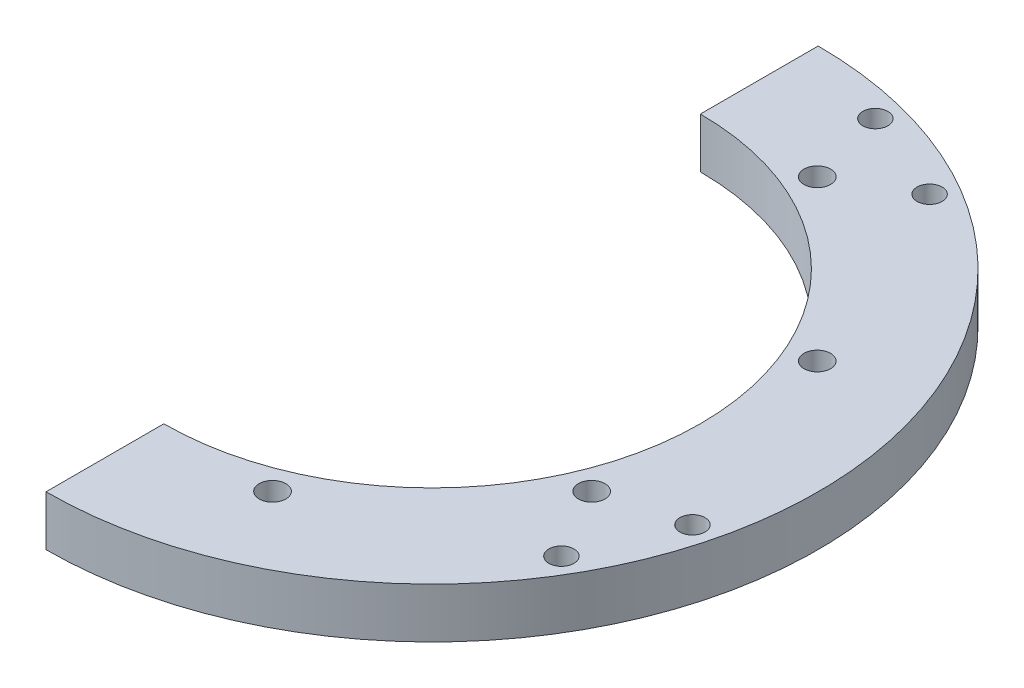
ISO-10303-21;
HEADER;
FILE_DESCRIPTION(('STEP AP214'),'2;1');
FILE_NAME('part.step','',(''),(''),'','','');
FILE_SCHEMA(('AUTOMOTIVE_DESIGN { 1 0 10303 214 1 1 1 1 }'));
ENDSEC;
DATA;
#1=APPLICATION_CONTEXT('core data for automotive mechanical design processes');
#2=APPLICATION_PROTOCOL_DEFINITION('international standard','automotive_design',2000,#1);
#3=PRODUCT_CONTEXT('',#1,'mechanical');
#4=PRODUCT('Part','Part','',(#3));
#5=PRODUCT_RELATED_PRODUCT_CATEGORY('part','',(#4));
#6=PRODUCT_DEFINITION_FORMATION('','',#4);
#7=PRODUCT_DEFINITION_CONTEXT('part definition',#1,'design');
#8=PRODUCT_DEFINITION('design','',#6,#7);
#9=PRODUCT_DEFINITION_SHAPE('','',#8);
#10=(LENGTH_UNIT() NAMED_UNIT(*) SI_UNIT(.MILLI.,.METRE.));
#11=(NAMED_UNIT(*) PLANE_ANGLE_UNIT() SI_UNIT($,.RADIAN.));
#12=(NAMED_UNIT(*) SI_UNIT($,.STERADIAN.) SOLID_ANGLE_UNIT());
#13=UNCERTAINTY_MEASURE_WITH_UNIT(LENGTH_MEASURE(1.E-05),#10,'distance_accuracy_value','');
#14=(GEOMETRIC_REPRESENTATION_CONTEXT(3) GLOBAL_UNCERTAINTY_ASSIGNED_CONTEXT((#13)) GLOBAL_UNIT_ASSIGNED_CONTEXT((#10,
#11,#12)) REPRESENTATION_CONTEXT('',''));
#15=CARTESIAN_POINT('',(0.,0.,0.));
#16=DIRECTION('',(0.,0.,1.));
#17=DIRECTION('',(1.,0.,0.));
#18=AXIS2_PLACEMENT_3D('',#15,#16,#17);
#19=CARTESIAN_POINT('',(0.,12.7,0.));
#20=DIRECTION('',(0.,-1.,0.));
#21=DIRECTION('',(0.,0.,-1.));
#22=AXIS2_PLACEMENT_3D('',#19,#20,#21);
#23=PLANE('',#22);
#24=CARTESIAN_POINT('',(28.577267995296,12.7,68.9916279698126));
#25=DIRECTION('',(0.,1.,0.));
#26=DIRECTION('',(0.,0.,1.));
#27=AXIS2_PLACEMENT_3D('',#24,#25,#26);
#28=CIRCLE('',#27,3.37819999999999);
#29=CARTESIAN_POINT('',(28.577267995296,12.7,72.3698279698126));
#30=VERTEX_POINT('',#29);
#31=EDGE_CURVE('E144',#30,#30,#28,.T.);
#32=ORIENTED_EDGE('',*,*,#31,.F.);
#33=EDGE_LOOP('',(#32));
#34=FACE_BOUND('',#33,.T.);
#35=CARTESIAN_POINT('',(0.,12.7,0.));
#36=DIRECTION('',(0.,-1.,0.));
#37=DIRECTION('',(0.,0.,-1.));
#38=AXIS2_PLACEMENT_3D('',#35,#36,#37);
#39=CIRCLE('',#38,67.945);
#40=CARTESIAN_POINT('',(0.,12.7,-67.945));
#41=VERTEX_POINT('',#40);
#42=CARTESIAN_POINT('',(0.,12.7,67.945));
#43=VERTEX_POINT('',#42);
#44=EDGE_CURVE('E85',#41,#43,#39,.T.);
#45=ORIENTED_EDGE('',*,*,#44,.T.);
#46=DIRECTION('',(0.,0.,1.));
#47=VECTOR('',#46,1.);
#48=CARTESIAN_POINT('',(0.,12.7,67.945));
#49=LINE('',#48,#47);
#50=CARTESIAN_POINT('',(0.,12.7,97.79));
#51=VERTEX_POINT('',#50);
#52=EDGE_CURVE('E80',#43,#51,#49,.T.);
#53=ORIENTED_EDGE('',*,*,#52,.T.);
#54=CARTESIAN_POINT('',(0.,12.7,0.));
#55=DIRECTION('',(0.,1.,0.));
#56=DIRECTION('',(0.,0.,-1.));
#57=AXIS2_PLACEMENT_3D('',#54,#55,#56);
#58=CIRCLE('',#57,97.79);
#59=CARTESIAN_POINT('',(0.,12.7,-97.79));
#60=VERTEX_POINT('',#59);
#61=EDGE_CURVE('E83',#51,#60,#58,.T.);
#62=ORIENTED_EDGE('',*,*,#61,.T.);
#63=DIRECTION('',(0.,0.,1.));
#64=VECTOR('',#63,1.);
#65=CARTESIAN_POINT('',(0.,12.7,-97.79));
#66=LINE('',#65,#64);
#67=EDGE_CURVE('E50',#60,#41,#66,.T.);
#68=ORIENTED_EDGE('',*,*,#67,.T.);
#69=EDGE_LOOP('',(#45,#53,#62,#68));
#70=FACE_BOUND('',#69,.T.);
#71=CARTESIAN_POINT('',(28.5772679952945,12.7,-68.9916279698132));
#72=DIRECTION('',(0.,1.,0.));
#73=DIRECTION('',(0.,0.,1.));
#74=AXIS2_PLACEMENT_3D('',#71,#72,#73);
#75=CIRCLE('',#74,3.37819999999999);
#76=CARTESIAN_POINT('',(28.5772679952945,12.7,-65.6134279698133));
#77=VERTEX_POINT('',#76);
#78=EDGE_CURVE('E114',#77,#77,#75,.T.);
#79=ORIENTED_EDGE('',*,*,#78,.F.);
#80=EDGE_LOOP('',(#79));
#81=FACE_BOUND('',#80,.T.);
#82=CARTESIAN_POINT('',(46.6320596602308,12.7,-79.393051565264));
#83=DIRECTION('',(0.,1.,0.));
#84=DIRECTION('',(0.,0.,1.));
#85=AXIS2_PLACEMENT_3D('',#82,#83,#84);
#86=CIRCLE('',#85,3.17499999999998);
#87=CARTESIAN_POINT('',(46.6320596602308,12.7,-76.218051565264));
#88=VERTEX_POINT('',#87);
#89=EDGE_CURVE('E120',#88,#88,#86,.T.);
#90=ORIENTED_EDGE('',*,*,#89,.F.);
#91=EDGE_LOOP('',(#90));
#92=FACE_BOUND('',#91,.T.);
#93=CARTESIAN_POINT('',(23.165519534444,12.7,-89.113210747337));
#94=DIRECTION('',(0.,1.,0.));
#95=DIRECTION('',(0.,0.,1.));
#96=AXIS2_PLACEMENT_3D('',#93,#94,#95);
#97=CIRCLE('',#96,3.17499999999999);
#98=CARTESIAN_POINT('',(23.165519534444,12.7,-85.938210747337));
#99=VERTEX_POINT('',#98);
#100=EDGE_CURVE('E126',#99,#99,#97,.T.);
#101=ORIENTED_EDGE('',*,*,#100,.F.);
#102=EDGE_LOOP('',(#101));
#103=FACE_BOUND('',#102,.T.);
#104=CARTESIAN_POINT('',(68.9916279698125,12.7,-28.5772679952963));
#105=DIRECTION('',(0.,1.,0.));
#106=DIRECTION('',(0.,0.,1.));
#107=AXIS2_PLACEMENT_3D('',#104,#105,#106);
#108=CIRCLE('',#107,3.37819999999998);
#109=CARTESIAN_POINT('',(68.9916279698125,12.7,-25.1990679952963));
#110=VERTEX_POINT('',#109);
#111=EDGE_CURVE('E132',#110,#110,#108,.T.);
#112=ORIENTED_EDGE('',*,*,#111,.F.);
#113=EDGE_LOOP('',(#112));
#114=FACE_BOUND('',#113,.T.);
#115=CARTESIAN_POINT('',(68.9916279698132,12.7,28.5772679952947));
#116=DIRECTION('',(0.,1.,0.));
#117=DIRECTION('',(0.,0.,1.));
#118=AXIS2_PLACEMENT_3D('',#115,#116,#117);
#119=CIRCLE('',#118,3.37819999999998);
#120=CARTESIAN_POINT('',(68.9916279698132,12.7,31.9554679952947));
#121=VERTEX_POINT('',#120);
#122=EDGE_CURVE('E138',#121,#121,#119,.T.);
#123=ORIENTED_EDGE('',*,*,#122,.F.);
#124=EDGE_LOOP('',(#123));
#125=FACE_BOUND('',#124,.T.);
#126=CARTESIAN_POINT('',(79.3930515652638,12.7,46.6320596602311));
#127=DIRECTION('',(0.,1.,0.));
#128=DIRECTION('',(0.,0.,1.));
#129=AXIS2_PLACEMENT_3D('',#126,#127,#128);
#130=CIRCLE('',#129,3.17499999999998);
#131=CARTESIAN_POINT('',(79.3930515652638,12.7,49.8070596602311));
#132=VERTEX_POINT('',#131);
#133=EDGE_CURVE('E150',#132,#132,#130,.T.);
#134=ORIENTED_EDGE('',*,*,#133,.F.);
#135=EDGE_LOOP('',(#134));
#136=FACE_BOUND('',#135,.T.);
#137=CARTESIAN_POINT('',(89.1132107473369,12.7,23.1655195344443));
#138=DIRECTION('',(0.,1.,0.));
#139=DIRECTION('',(0.,0.,1.));
#140=AXIS2_PLACEMENT_3D('',#137,#138,#139);
#141=CIRCLE('',#140,3.17499999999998);
#142=CARTESIAN_POINT('',(89.1132107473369,12.7,26.3405195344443));
#143=VERTEX_POINT('',#142);
#144=EDGE_CURVE('E156',#143,#143,#141,.T.);
#145=ORIENTED_EDGE('',*,*,#144,.F.);
#146=EDGE_LOOP('',(#145));
#147=FACE_BOUND('',#146,.T.);
#148=ADVANCED_FACE('F33',(#34,#70,#81,#92,#103,#114,#125,#136,#147),#23,.F.);
#149=CARTESIAN_POINT('',(0.,0.,0.));
#150=DIRECTION('',(0.,-1.,0.));
#151=DIRECTION('',(0.,0.,-1.));
#152=AXIS2_PLACEMENT_3D('',#149,#150,#151);
#153=PLANE('',#152);
#154=CARTESIAN_POINT('',(89.1132107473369,0.,23.1655195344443));
#155=DIRECTION('',(0.,1.,0.));
#156=DIRECTION('',(0.,0.,1.));
#157=AXIS2_PLACEMENT_3D('',#154,#155,#156);
#158=CIRCLE('',#157,3.175);
#159=CARTESIAN_POINT('',(89.1132107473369,0.,26.3405195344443));
#160=VERTEX_POINT('',#159);
#161=EDGE_CURVE('E153',#160,#160,#158,.T.);
#162=ORIENTED_EDGE('',*,*,#161,.T.);
#163=EDGE_LOOP('',(#162));
#164=FACE_BOUND('',#163,.T.);
#165=CARTESIAN_POINT('',(28.577267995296,0.,68.9916279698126));
#166=DIRECTION('',(0.,1.,0.));
#167=DIRECTION('',(0.,0.,1.));
#168=AXIS2_PLACEMENT_3D('',#165,#166,#167);
#169=CIRCLE('',#168,3.3782);
#170=CARTESIAN_POINT('',(28.577267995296,0.,72.3698279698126));
#171=VERTEX_POINT('',#170);
#172=EDGE_CURVE('E141',#171,#171,#169,.T.);
#173=ORIENTED_EDGE('',*,*,#172,.T.);
#174=EDGE_LOOP('',(#173));
#175=FACE_BOUND('',#174,.T.);
#176=CARTESIAN_POINT('',(68.9916279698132,0.,28.5772679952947));
#177=DIRECTION('',(0.,1.,0.));
#178=DIRECTION('',(0.,0.,1.));
#179=AXIS2_PLACEMENT_3D('',#176,#177,#178);
#180=CIRCLE('',#179,3.3782);
#181=CARTESIAN_POINT('',(68.9916279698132,0.,31.9554679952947));
#182=VERTEX_POINT('',#181);
#183=EDGE_CURVE('E135',#182,#182,#180,.T.);
#184=ORIENTED_EDGE('',*,*,#183,.T.);
#185=EDGE_LOOP('',(#184));
#186=FACE_BOUND('',#185,.T.);
#187=CARTESIAN_POINT('',(0.,0.,0.));
#188=DIRECTION('',(0.,-1.,0.));
#189=DIRECTION('',(0.,0.,-1.));
#190=AXIS2_PLACEMENT_3D('',#187,#188,#189);
#191=CIRCLE('',#190,67.945);
#192=CARTESIAN_POINT('',(0.,0.,-67.945));
#193=VERTEX_POINT('',#192);
#194=CARTESIAN_POINT('',(0.,0.,67.945));
#195=VERTEX_POINT('',#194);
#196=EDGE_CURVE('E97',#193,#195,#191,.T.);
#197=ORIENTED_EDGE('',*,*,#196,.F.);
#198=DIRECTION('',(0.,0.,1.));
#199=VECTOR('',#198,1.);
#200=CARTESIAN_POINT('',(0.,0.,-97.79));
#201=LINE('',#200,#199);
#202=CARTESIAN_POINT('',(0.,0.,-97.79));
#203=VERTEX_POINT('',#202);
#204=EDGE_CURVE('E73',#203,#193,#201,.T.);
#205=ORIENTED_EDGE('',*,*,#204,.F.);
#206=CARTESIAN_POINT('',(0.,0.,0.));
#207=DIRECTION('',(0.,1.,0.));
#208=DIRECTION('',(0.,0.,-1.));
#209=AXIS2_PLACEMENT_3D('',#206,#207,#208);
#210=CIRCLE('',#209,97.79);
#211=CARTESIAN_POINT('',(0.,0.,97.79));
#212=VERTEX_POINT('',#211);
#213=EDGE_CURVE('E67',#212,#203,#210,.T.);
#214=ORIENTED_EDGE('',*,*,#213,.F.);
#215=DIRECTION('',(0.,0.,1.));
#216=VECTOR('',#215,1.);
#217=CARTESIAN_POINT('',(0.,0.,67.945));
#218=LINE('',#217,#216);
#219=EDGE_CURVE('E89',#195,#212,#218,.T.);
#220=ORIENTED_EDGE('',*,*,#219,.F.);
#221=EDGE_LOOP('',(#197,#205,#214,#220));
#222=FACE_BOUND('',#221,.T.);
#223=CARTESIAN_POINT('',(28.5772679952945,0.,-68.9916279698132));
#224=DIRECTION('',(0.,1.,0.));
#225=DIRECTION('',(0.,0.,1.));
#226=AXIS2_PLACEMENT_3D('',#223,#224,#225);
#227=CIRCLE('',#226,3.37819999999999);
#228=CARTESIAN_POINT('',(28.5772679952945,0.,-65.6134279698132));
#229=VERTEX_POINT('',#228);
#230=EDGE_CURVE('E100',#229,#229,#227,.T.);
#231=ORIENTED_EDGE('',*,*,#230,.T.);
#232=EDGE_LOOP('',(#231));
#233=FACE_BOUND('',#232,.T.);
#234=CARTESIAN_POINT('',(46.6320596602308,0.,-79.393051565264));
#235=DIRECTION('',(0.,1.,0.));
#236=DIRECTION('',(0.,0.,1.));
#237=AXIS2_PLACEMENT_3D('',#234,#235,#236);
#238=CIRCLE('',#237,3.175);
#239=CARTESIAN_POINT('',(46.6320596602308,0.,-76.218051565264));
#240=VERTEX_POINT('',#239);
#241=EDGE_CURVE('E117',#240,#240,#238,.T.);
#242=ORIENTED_EDGE('',*,*,#241,.T.);
#243=EDGE_LOOP('',(#242));
#244=FACE_BOUND('',#243,.T.);
#245=CARTESIAN_POINT('',(23.165519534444,0.,-89.113210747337));
#246=DIRECTION('',(0.,1.,0.));
#247=DIRECTION('',(0.,0.,1.));
#248=AXIS2_PLACEMENT_3D('',#245,#246,#247);
#249=CIRCLE('',#248,3.175);
#250=CARTESIAN_POINT('',(23.165519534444,0.,-85.938210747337));
#251=VERTEX_POINT('',#250);
#252=EDGE_CURVE('E123',#251,#251,#249,.T.);
#253=ORIENTED_EDGE('',*,*,#252,.T.);
#254=EDGE_LOOP('',(#253));
#255=FACE_BOUND('',#254,.T.);
#256=CARTESIAN_POINT('',(68.9916279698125,0.,-28.5772679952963));
#257=DIRECTION('',(0.,1.,0.));
#258=DIRECTION('',(0.,0.,1.));
#259=AXIS2_PLACEMENT_3D('',#256,#257,#258);
#260=CIRCLE('',#259,3.3782);
#261=CARTESIAN_POINT('',(68.9916279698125,0.,-25.1990679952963));
#262=VERTEX_POINT('',#261);
#263=EDGE_CURVE('E129',#262,#262,#260,.T.);
#264=ORIENTED_EDGE('',*,*,#263,.T.);
#265=EDGE_LOOP('',(#264));
#266=FACE_BOUND('',#265,.T.);
#267=CARTESIAN_POINT('',(79.3930515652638,0.,46.6320596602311));
#268=DIRECTION('',(0.,1.,0.));
#269=DIRECTION('',(0.,0.,1.));
#270=AXIS2_PLACEMENT_3D('',#267,#268,#269);
#271=CIRCLE('',#270,3.175);
#272=CARTESIAN_POINT('',(79.3930515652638,0.,49.8070596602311));
#273=VERTEX_POINT('',#272);
#274=EDGE_CURVE('E147',#273,#273,#271,.T.);
#275=ORIENTED_EDGE('',*,*,#274,.T.);
#276=EDGE_LOOP('',(#275));
#277=FACE_BOUND('',#276,.T.);
#278=ADVANCED_FACE('F108',(#164,#175,#186,#222,#233,#244,#255,#266,#277),#153,.T.);
#279=CARTESIAN_POINT('',(0.,12.7,0.));
#280=DIRECTION('',(0.,-1.,0.));
#281=DIRECTION('',(0.,0.,-1.));
#282=AXIS2_PLACEMENT_3D('',#279,#280,#281);
#283=CYLINDRICAL_SURFACE('',#282,67.945);
#284=ORIENTED_EDGE('',*,*,#196,.T.);
#285=DIRECTION('',(0.,-1.,0.));
#286=VECTOR('',#285,1.);
#287=CARTESIAN_POINT('',(0.,12.7,67.945));
#288=LINE('',#287,#286);
#289=EDGE_CURVE('E11',#43,#195,#288,.T.);
#290=ORIENTED_EDGE('',*,*,#289,.F.);
#291=ORIENTED_EDGE('',*,*,#44,.F.);
#292=DIRECTION('',(0.,-1.,0.));
#293=VECTOR('',#292,1.);
#294=CARTESIAN_POINT('',(0.,12.7,-67.945));
#295=LINE('',#294,#293);
#296=EDGE_CURVE('E93',#41,#193,#295,.T.);
#297=ORIENTED_EDGE('',*,*,#296,.T.);
#298=EDGE_LOOP('',(#284,#290,#291,#297));
#299=FACE_BOUND('',#298,.T.);
#300=ADVANCED_FACE('F35',(#299),#283,.F.);
#301=CARTESIAN_POINT('',(0.,12.7,67.945));
#302=DIRECTION('',(1.,0.,0.));
#303=DIRECTION('',(0.,0.,-1.));
#304=AXIS2_PLACEMENT_3D('',#301,#302,#303);
#305=PLANE('',#304);
#306=ORIENTED_EDGE('',*,*,#219,.T.);
#307=DIRECTION('',(0.,-1.,0.));
#308=VECTOR('',#307,1.);
#309=CARTESIAN_POINT('',(0.,12.7,97.79));
#310=LINE('',#309,#308);
#311=EDGE_CURVE('E42',#51,#212,#310,.T.);
#312=ORIENTED_EDGE('',*,*,#311,.F.);
#313=ORIENTED_EDGE('',*,*,#52,.F.);
#314=ORIENTED_EDGE('',*,*,#289,.T.);
#315=EDGE_LOOP('',(#306,#312,#313,#314));
#316=FACE_BOUND('',#315,.T.);
#317=ADVANCED_FACE('F88',(#316),#305,.F.);
#318=CARTESIAN_POINT('',(0.,12.7,0.));
#319=DIRECTION('',(0.,-1.,0.));
#320=DIRECTION('',(0.,0.,-1.));
#321=AXIS2_PLACEMENT_3D('',#318,#319,#320);
#322=CYLINDRICAL_SURFACE('',#321,97.79);
#323=ORIENTED_EDGE('',*,*,#213,.T.);
#324=DIRECTION('',(0.,-1.,0.));
#325=VECTOR('',#324,1.);
#326=CARTESIAN_POINT('',(0.,12.7,-97.79));
#327=LINE('',#326,#325);
#328=EDGE_CURVE('E90',#60,#203,#327,.T.);
#329=ORIENTED_EDGE('',*,*,#328,.F.);
#330=ORIENTED_EDGE('',*,*,#61,.F.);
#331=ORIENTED_EDGE('',*,*,#311,.T.);
#332=EDGE_LOOP('',(#323,#329,#330,#331));
#333=FACE_BOUND('',#332,.T.);
#334=ADVANCED_FACE('F91',(#333),#322,.T.);
#335=CARTESIAN_POINT('',(0.,12.7,-97.79));
#336=DIRECTION('',(1.,0.,0.));
#337=DIRECTION('',(0.,0.,-1.));
#338=AXIS2_PLACEMENT_3D('',#335,#336,#337);
#339=PLANE('',#338);
#340=ORIENTED_EDGE('',*,*,#204,.T.);
#341=ORIENTED_EDGE('',*,*,#296,.F.);
#342=ORIENTED_EDGE('',*,*,#67,.F.);
#343=ORIENTED_EDGE('',*,*,#328,.T.);
#344=EDGE_LOOP('',(#340,#341,#342,#343));
#345=FACE_BOUND('',#344,.T.);
#346=ADVANCED_FACE('F105',(#345),#339,.F.);
#347=CARTESIAN_POINT('',(28.5772679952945,12.7,-68.9916279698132));
#348=DIRECTION('',(0.,1.,0.));
#349=DIRECTION('',(0.,0.,1.));
#350=AXIS2_PLACEMENT_3D('',#347,#348,#349);
#351=CYLINDRICAL_SURFACE('',#350,3.37819999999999);
#352=ORIENTED_EDGE('',*,*,#230,.F.);
#353=EDGE_LOOP('',(#352));
#354=FACE_BOUND('',#353,.T.);
#355=ORIENTED_EDGE('',*,*,#78,.T.);
#356=EDGE_LOOP('',(#355));
#357=FACE_BOUND('',#356,.T.);
#358=ADVANCED_FACE('F172',(#354,#357),#351,.F.);
#359=CARTESIAN_POINT('',(46.6320596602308,12.7,-79.393051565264));
#360=DIRECTION('',(0.,1.,0.));
#361=DIRECTION('',(0.,0.,1.));
#362=AXIS2_PLACEMENT_3D('',#359,#360,#361);
#363=CYLINDRICAL_SURFACE('',#362,3.17499999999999);
#364=ORIENTED_EDGE('',*,*,#241,.F.);
#365=EDGE_LOOP('',(#364));
#366=FACE_BOUND('',#365,.T.);
#367=ORIENTED_EDGE('',*,*,#89,.T.);
#368=EDGE_LOOP('',(#367));
#369=FACE_BOUND('',#368,.T.);
#370=ADVANCED_FACE('F231',(#366,#369),#363,.F.);
#371=CARTESIAN_POINT('',(23.165519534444,12.7,-89.113210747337));
#372=DIRECTION('',(0.,1.,0.));
#373=DIRECTION('',(0.,0.,1.));
#374=AXIS2_PLACEMENT_3D('',#371,#372,#373);
#375=CYLINDRICAL_SURFACE('',#374,3.17499999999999);
#376=ORIENTED_EDGE('',*,*,#252,.F.);
#377=EDGE_LOOP('',(#376));
#378=FACE_BOUND('',#377,.T.);
#379=ORIENTED_EDGE('',*,*,#100,.T.);
#380=EDGE_LOOP('',(#379));
#381=FACE_BOUND('',#380,.T.);
#382=ADVANCED_FACE('F228',(#378,#381),#375,.F.);
#383=CARTESIAN_POINT('',(68.9916279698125,12.7,-28.5772679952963));
#384=DIRECTION('',(0.,1.,0.));
#385=DIRECTION('',(0.,0.,1.));
#386=AXIS2_PLACEMENT_3D('',#383,#384,#385);
#387=CYLINDRICAL_SURFACE('',#386,3.37819999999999);
#388=ORIENTED_EDGE('',*,*,#263,.F.);
#389=EDGE_LOOP('',(#388));
#390=FACE_BOUND('',#389,.T.);
#391=ORIENTED_EDGE('',*,*,#111,.T.);
#392=EDGE_LOOP('',(#391));
#393=FACE_BOUND('',#392,.T.);
#394=ADVANCED_FACE('F224',(#390,#393),#387,.F.);
#395=CARTESIAN_POINT('',(68.9916279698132,12.7,28.5772679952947));
#396=DIRECTION('',(0.,1.,0.));
#397=DIRECTION('',(0.,0.,1.));
#398=AXIS2_PLACEMENT_3D('',#395,#396,#397);
#399=CYLINDRICAL_SURFACE('',#398,3.37819999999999);
#400=ORIENTED_EDGE('',*,*,#183,.F.);
#401=EDGE_LOOP('',(#400));
#402=FACE_BOUND('',#401,.T.);
#403=ORIENTED_EDGE('',*,*,#122,.T.);
#404=EDGE_LOOP('',(#403));
#405=FACE_BOUND('',#404,.T.);
#406=ADVANCED_FACE('F220',(#402,#405),#399,.F.);
#407=CARTESIAN_POINT('',(28.577267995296,12.7,68.9916279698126));
#408=DIRECTION('',(0.,1.,0.));
#409=DIRECTION('',(0.,0.,1.));
#410=AXIS2_PLACEMENT_3D('',#407,#408,#409);
#411=CYLINDRICAL_SURFACE('',#410,3.37819999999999);
#412=ORIENTED_EDGE('',*,*,#172,.F.);
#413=EDGE_LOOP('',(#412));
#414=FACE_BOUND('',#413,.T.);
#415=ORIENTED_EDGE('',*,*,#31,.T.);
#416=EDGE_LOOP('',(#415));
#417=FACE_BOUND('',#416,.T.);
#418=ADVANCED_FACE('F202',(#414,#417),#411,.F.);
#419=CARTESIAN_POINT('',(79.3930515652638,12.7,46.6320596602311));
#420=DIRECTION('',(0.,1.,0.));
#421=DIRECTION('',(0.,0.,1.));
#422=AXIS2_PLACEMENT_3D('',#419,#420,#421);
#423=CYLINDRICAL_SURFACE('',#422,3.17499999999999);
#424=ORIENTED_EDGE('',*,*,#274,.F.);
#425=EDGE_LOOP('',(#424));
#426=FACE_BOUND('',#425,.T.);
#427=ORIENTED_EDGE('',*,*,#133,.T.);
#428=EDGE_LOOP('',(#427));
#429=FACE_BOUND('',#428,.T.);
#430=ADVANCED_FACE('F197',(#426,#429),#423,.F.);
#431=CARTESIAN_POINT('',(89.1132107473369,12.7,23.1655195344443));
#432=DIRECTION('',(0.,1.,0.));
#433=DIRECTION('',(0.,0.,1.));
#434=AXIS2_PLACEMENT_3D('',#431,#432,#433);
#435=CYLINDRICAL_SURFACE('',#434,3.17499999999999);
#436=ORIENTED_EDGE('',*,*,#161,.F.);
#437=EDGE_LOOP('',(#436));
#438=FACE_BOUND('',#437,.T.);
#439=ORIENTED_EDGE('',*,*,#144,.T.);
#440=EDGE_LOOP('',(#439));
#441=FACE_BOUND('',#440,.T.);
#442=ADVANCED_FACE('F160',(#438,#441),#435,.F.);
#443=CLOSED_SHELL('',(#148,#278,#300,#317,#334,#346,#358,#370,#382,#394,#406,#418,#430,#442));
#444=MANIFOLD_SOLID_BREP('B2',#443);
#445=ADVANCED_BREP_SHAPE_REPRESENTATION('',(#18,#444),#14);
#446=SHAPE_DEFINITION_REPRESENTATION(#9,#445);
ENDSEC;
END-ISO-10303-21;
